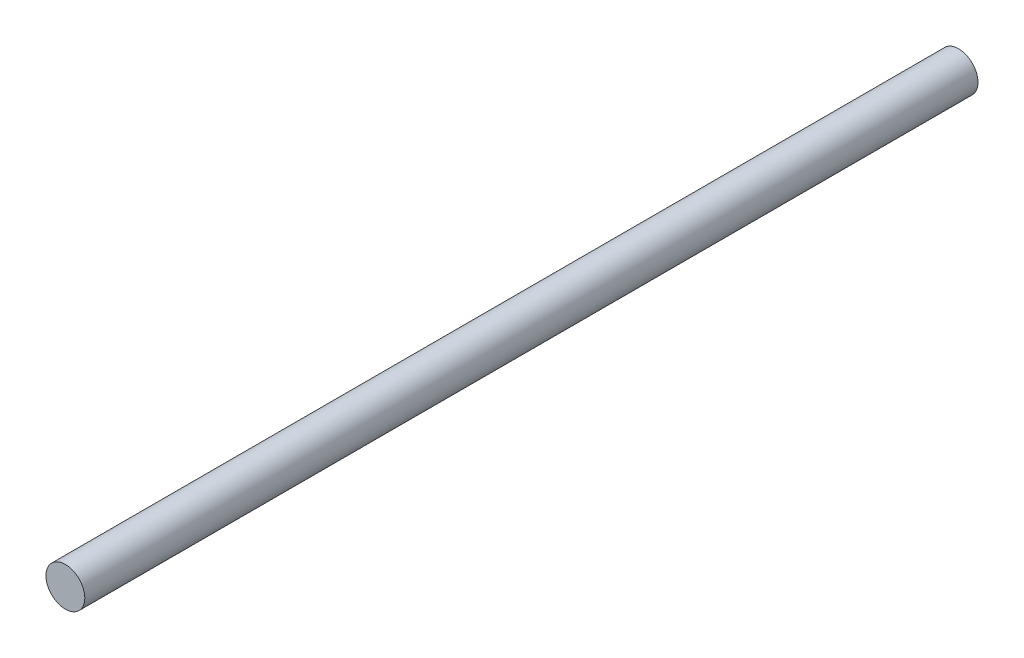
ISO-10303-21;
HEADER;
FILE_DESCRIPTION(('STEP AP214'),'2;1');
FILE_NAME('part.step','',(''),(''),'','','');
FILE_SCHEMA(('AUTOMOTIVE_DESIGN { 1 0 10303 214 1 1 1 1 }'));
ENDSEC;
DATA;
#1=APPLICATION_CONTEXT('core data for automotive mechanical design processes');
#2=APPLICATION_PROTOCOL_DEFINITION('international standard','automotive_design',2000,#1);
#3=PRODUCT_CONTEXT('',#1,'mechanical');
#4=PRODUCT('Part','Part','',(#3));
#5=PRODUCT_RELATED_PRODUCT_CATEGORY('part','',(#4));
#6=PRODUCT_DEFINITION_FORMATION('','',#4);
#7=PRODUCT_DEFINITION_CONTEXT('part definition',#1,'design');
#8=PRODUCT_DEFINITION('design','',#6,#7);
#9=PRODUCT_DEFINITION_SHAPE('','',#8);
#10=(LENGTH_UNIT() NAMED_UNIT(*) SI_UNIT(.MILLI.,.METRE.));
#11=(NAMED_UNIT(*) PLANE_ANGLE_UNIT() SI_UNIT($,.RADIAN.));
#12=(NAMED_UNIT(*) SI_UNIT($,.STERADIAN.) SOLID_ANGLE_UNIT());
#13=UNCERTAINTY_MEASURE_WITH_UNIT(LENGTH_MEASURE(1.E-05),#10,'distance_accuracy_value','');
#14=(GEOMETRIC_REPRESENTATION_CONTEXT(3) GLOBAL_UNCERTAINTY_ASSIGNED_CONTEXT((#13)) GLOBAL_UNIT_ASSIGNED_CONTEXT((#10,
#11,#12)) REPRESENTATION_CONTEXT('',''));
#15=CARTESIAN_POINT('',(0.,0.,0.));
#16=DIRECTION('',(0.,0.,1.));
#17=DIRECTION('',(1.,0.,0.));
#18=AXIS2_PLACEMENT_3D('',#15,#16,#17);
#19=CARTESIAN_POINT('',(0.,0.,69.));
#20=DIRECTION('',(0.,0.,-1.));
#21=DIRECTION('',(-1.,0.,0.));
#22=AXIS2_PLACEMENT_3D('',#19,#20,#21);
#23=CYLINDRICAL_SURFACE('',#22,1.5);
#24=CARTESIAN_POINT('',(0.,0.,69.));
#25=DIRECTION('',(0.,0.,1.));
#26=DIRECTION('',(1.,0.,0.));
#27=AXIS2_PLACEMENT_3D('',#24,#25,#26);
#28=CIRCLE('',#27,1.5);
#29=CARTESIAN_POINT('',(1.5,0.,69.));
#30=VERTEX_POINT('',#29);
#31=EDGE_CURVE('E10',#30,#30,#28,.T.);
#32=ORIENTED_EDGE('',*,*,#31,.F.);
#33=EDGE_LOOP('',(#32));
#34=FACE_BOUND('',#33,.T.);
#35=CARTESIAN_POINT('',(0.,0.,0.));
#36=DIRECTION('',(0.,0.,1.));
#37=DIRECTION('',(1.,0.,0.));
#38=AXIS2_PLACEMENT_3D('',#35,#36,#37);
#39=CIRCLE('',#38,1.5);
#40=CARTESIAN_POINT('',(1.5,0.,0.));
#41=VERTEX_POINT('',#40);
#42=EDGE_CURVE('E34',#41,#41,#39,.T.);
#43=ORIENTED_EDGE('',*,*,#42,.T.);
#44=EDGE_LOOP('',(#43));
#45=FACE_BOUND('',#44,.T.);
#46=ADVANCED_FACE('F31',(#34,#45),#23,.T.);
#47=CARTESIAN_POINT('',(0.,0.,69.));
#48=DIRECTION('',(0.,0.,1.));
#49=DIRECTION('',(1.,0.,0.));
#50=AXIS2_PLACEMENT_3D('',#47,#48,#49);
#51=PLANE('',#50);
#52=ORIENTED_EDGE('',*,*,#31,.T.);
#53=EDGE_LOOP('',(#52));
#54=FACE_BOUND('',#53,.T.);
#55=ADVANCED_FACE('F46',(#54),#51,.T.);
#56=CARTESIAN_POINT('',(0.,0.,0.));
#57=DIRECTION('',(0.,0.,1.));
#58=DIRECTION('',(1.,0.,0.));
#59=AXIS2_PLACEMENT_3D('',#56,#57,#58);
#60=PLANE('',#59);
#61=ORIENTED_EDGE('',*,*,#42,.F.);
#62=EDGE_LOOP('',(#61));
#63=FACE_BOUND('',#62,.T.);
#64=ADVANCED_FACE('F44',(#63),#60,.F.);
#65=CLOSED_SHELL('',(#46,#55,#64));
#66=MANIFOLD_SOLID_BREP('B2',#65);
#67=ADVANCED_BREP_SHAPE_REPRESENTATION('',(#18,#66),#14);
#68=SHAPE_DEFINITION_REPRESENTATION(#9,#67);
ENDSEC;
END-ISO-10303-21;
